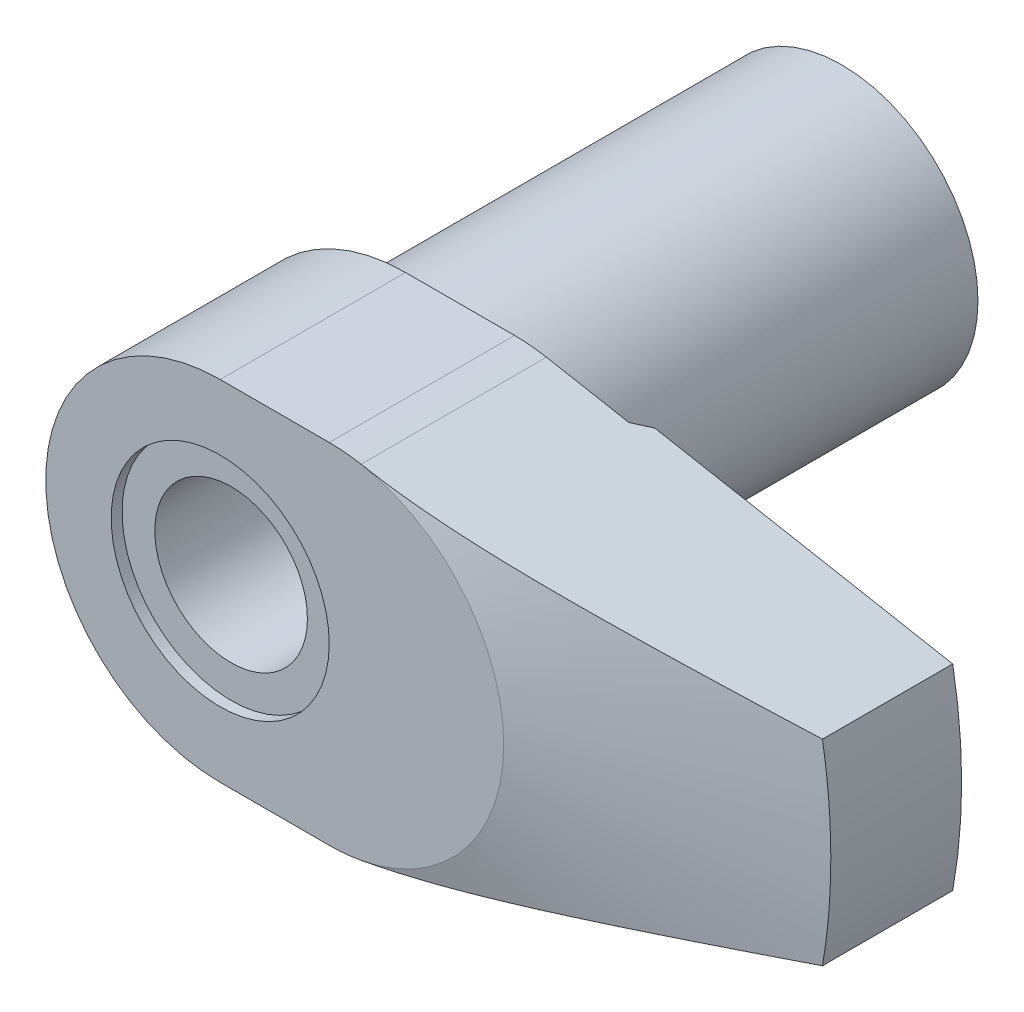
ISO-10303-21;
HEADER;
FILE_DESCRIPTION(('STEP AP214'),'2;1');
FILE_NAME('part.step','',(''),(''),'','','');
FILE_SCHEMA(('AUTOMOTIVE_DESIGN { 1 0 10303 214 1 1 1 1 }'));
ENDSEC;
DATA;
#1=APPLICATION_CONTEXT('core data for automotive mechanical design processes');
#2=APPLICATION_PROTOCOL_DEFINITION('international standard','automotive_design',2000,#1);
#3=PRODUCT_CONTEXT('',#1,'mechanical');
#4=PRODUCT('Part','Part','',(#3));
#5=PRODUCT_RELATED_PRODUCT_CATEGORY('part','',(#4));
#6=PRODUCT_DEFINITION_FORMATION('','',#4);
#7=PRODUCT_DEFINITION_CONTEXT('part definition',#1,'design');
#8=PRODUCT_DEFINITION('design','',#6,#7);
#9=PRODUCT_DEFINITION_SHAPE('','',#8);
#10=(LENGTH_UNIT() NAMED_UNIT(*) SI_UNIT(.MILLI.,.METRE.));
#11=(NAMED_UNIT(*) PLANE_ANGLE_UNIT() SI_UNIT($,.RADIAN.));
#12=(NAMED_UNIT(*) SI_UNIT($,.STERADIAN.) SOLID_ANGLE_UNIT());
#13=UNCERTAINTY_MEASURE_WITH_UNIT(LENGTH_MEASURE(1.E-05),#10,'distance_accuracy_value','');
#14=(GEOMETRIC_REPRESENTATION_CONTEXT(3) GLOBAL_UNCERTAINTY_ASSIGNED_CONTEXT((#13)) GLOBAL_UNIT_ASSIGNED_CONTEXT((#10,
#11,#12)) REPRESENTATION_CONTEXT('',''));
#15=CARTESIAN_POINT('',(0.,0.,0.));
#16=DIRECTION('',(0.,0.,1.));
#17=DIRECTION('',(1.,0.,0.));
#18=AXIS2_PLACEMENT_3D('',#15,#16,#17);
#19=CARTESIAN_POINT('',(49.1833305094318,9.,39.));
#20=DIRECTION('',(0.182505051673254,0.983204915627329,0.));
#21=DIRECTION('',(-0.983204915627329,0.182505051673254,0.));
#22=AXIS2_PLACEMENT_3D('',#19,#20,#21);
#23=PLANE('',#22);
#24=CARTESIAN_POINT('',(49.1835305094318,8.99996287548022,50.9490411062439));
#25=CARTESIAN_POINT('',(48.4363157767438,9.1386628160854,51.1233294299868));
#26=CARTESIAN_POINT('',(47.6889224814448,9.27739590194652,51.2968298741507));
#27=CARTESIAN_POINT('',(46.1937064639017,9.5549417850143,51.6419204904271));
#28=CARTESIAN_POINT('',(45.4458837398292,9.69375458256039,51.813510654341));
#29=CARTESIAN_POINT('',(43.9498561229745,9.97145111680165,52.1544189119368));
#30=CARTESIAN_POINT('',(43.2016513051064,10.1103348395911,52.3237373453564));
#31=CARTESIAN_POINT('',(41.7046595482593,10.3882103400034,52.6596906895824));
#32=CARTESIAN_POINT('',(40.9558726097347,10.527202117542,52.8263256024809));
#33=CARTESIAN_POINT('',(39.4594248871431,10.8049766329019,53.1559693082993));
#34=CARTESIAN_POINT('',(38.7117657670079,10.94375906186,53.3189859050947));
#35=CARTESIAN_POINT('',(37.2156374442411,11.2214742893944,53.641125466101));
#36=CARTESIAN_POINT('',(36.4671682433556,11.3604070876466,53.8002484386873));
#37=CARTESIAN_POINT('',(34.9690951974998,11.6384832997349,54.1137697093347));
#38=CARTESIAN_POINT('',(34.2194911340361,11.7776267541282,54.2681669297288));
#39=CARTESIAN_POINT('',(32.7191323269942,12.0561272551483,54.571090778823));
#40=CARTESIAN_POINT('',(31.9683775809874,12.1954843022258,54.719617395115));
#41=CARTESIAN_POINT('',(30.4629252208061,12.4749302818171,55.00987729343));
#42=CARTESIAN_POINT('',(29.7082229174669,12.6150200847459,55.1515855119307));
#43=CARTESIAN_POINT('',(28.1972026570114,12.8954995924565,55.4258274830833));
#44=CARTESIAN_POINT('',(27.4408847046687,13.0358892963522,55.5583612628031));
#45=CARTESIAN_POINT('',(25.9267833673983,13.3169407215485,55.8118665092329));
#46=CARTESIAN_POINT('',(25.1690009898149,13.4576022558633,55.9328441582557));
#47=CARTESIAN_POINT('',(23.6513180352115,13.7393185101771,56.1604558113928));
#48=CARTESIAN_POINT('',(22.8914174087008,13.8803732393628,56.2670894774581));
#49=CARTESIAN_POINT('',(21.3673908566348,14.163267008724,56.4628797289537));
#50=CARTESIAN_POINT('',(20.6032590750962,14.3051071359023,56.5519896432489));
#51=CARTESIAN_POINT('',(19.0728856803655,14.5891790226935,56.7086223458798));
#52=CARTESIAN_POINT('',(18.3066442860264,14.7314107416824,56.7761472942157));
#53=CARTESIAN_POINT('',(17.1552699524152,14.9451318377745,56.8586386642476));
#54=CARTESIAN_POINT('',(16.7707772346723,15.0165023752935,56.8830172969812));
#55=CARTESIAN_POINT('',(16.0014376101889,15.1593091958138,56.92510762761));
#56=CARTESIAN_POINT('',(15.6165907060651,15.2307454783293,56.9428193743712));
#57=CARTESIAN_POINT('',(14.8465043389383,15.3736909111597,56.9712828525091));
#58=CARTESIAN_POINT('',(14.4612647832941,15.4452000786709,56.9820320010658));
#59=CARTESIAN_POINT('',(13.6906447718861,15.5882445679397,56.9964020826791));
#60=CARTESIAN_POINT('',(13.3052643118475,15.6597798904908,57.0000227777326));
#61=CARTESIAN_POINT('',(12.9198808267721,15.731315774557,56.9999999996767));
#62=B_SPLINE_CURVE_WITH_KNOTS('',3,(#24,#25,#26,#27,#28,#29,#30,#31,#32,#33,#34,#35,#36,#37,#38,
#39,#40,#41,#42,#43,#44,#45,#46,#47,#48,#49,#50,#51,#52,#53,#54,#55,#56,#57,#58,#59,#60,#61),
.UNSPECIFIED.,.F.,.F.,(4,2,2,2,2,2,2,2,2,2,2,2,2,2,2,2,2,2,4),(0.,2.33912374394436,
4.67825752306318,7.01703749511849,9.35581564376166,11.6889301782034,14.0220396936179,
16.3556773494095,18.689319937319,21.0309713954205,23.372615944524,25.7130006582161,
28.0534405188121,30.4000316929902,32.7463879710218,33.9217995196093,35.0972024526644,
36.2730411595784,37.4489191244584),.UNSPECIFIED.);
#63=CARTESIAN_POINT('',(49.1833305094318,9.,50.9490877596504));
#64=VERTEX_POINT('',#63);
#65=CARTESIAN_POINT('',(12.9200808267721,15.7312786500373,57.));
#66=VERTEX_POINT('',#65);
#67=EDGE_CURVE('E98',#64,#66,#62,.T.);
#68=ORIENTED_EDGE('',*,*,#67,.F.);
#69=DIRECTION('',(0.,0.,1.));
#70=VECTOR('',#69,1.);
#71=CARTESIAN_POINT('',(49.1833305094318,9.,39.));
#72=LINE('',#71,#70);
#73=CARTESIAN_POINT('',(49.1833305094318,9.,39.));
#74=VERTEX_POINT('',#73);
#75=EDGE_CURVE('E147',#74,#64,#72,.T.);
#76=ORIENTED_EDGE('',*,*,#75,.F.);
#77=DIRECTION('',(-0.983204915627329,0.182505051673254,0.));
#78=VECTOR('',#77,1.);
#79=CARTESIAN_POINT('',(49.1833305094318,9.,39.));
#80=LINE('',#79,#78);
#81=CARTESIAN_POINT('',(21.8632225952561,14.0712294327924,39.));
#82=VERTEX_POINT('',#81);
#83=EDGE_CURVE('E154',#74,#82,#80,.T.);
#84=ORIENTED_EDGE('',*,*,#83,.T.);
#85=CARTESIAN_POINT('',(21.8634927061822,14.0711792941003,38.9998));
#86=CARTESIAN_POINT('',(21.7495401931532,14.092331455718,39.0841746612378));
#87=CARTESIAN_POINT('',(21.6354174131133,14.1135152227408,39.1683116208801));
#88=CARTESIAN_POINT('',(21.4068219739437,14.1559477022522,39.3360875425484));
#89=CARTESIAN_POINT('',(21.2923493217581,14.177196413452,39.4197265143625));
#90=CARTESIAN_POINT('',(21.0630401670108,14.2197613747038,39.586487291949));
#91=CARTESIAN_POINT('',(20.948203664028,14.2410776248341,39.6696090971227));
#92=CARTESIAN_POINT('',(20.7181524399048,14.2837803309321,39.8353143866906));
#93=CARTESIAN_POINT('',(20.60293771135,14.305166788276,39.917897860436));
#94=CARTESIAN_POINT('',(20.4875288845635,14.3265892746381,40.0002));
#95=B_SPLINE_CURVE_WITH_KNOTS('',3,(#85,#86,#87,#88,#89,#90,#91,#92,#93,#94),.UNSPECIFIED.,.F.,
.F.,(4,2,2,2,4),(0.,0.430075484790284,0.860142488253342,1.29020998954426,1.72028597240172),.UNSPECIFIED.);
#96=CARTESIAN_POINT('',(20.4878093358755,14.3265372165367,40.));
#97=VERTEX_POINT('',#96);
#98=EDGE_CURVE('E187',#82,#97,#95,.T.);
#99=ORIENTED_EDGE('',*,*,#98,.T.);
#100=DIRECTION('',(0.983204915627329,-0.182505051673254,0.));
#101=VECTOR('',#100,1.);
#102=CARTESIAN_POINT('',(12.9200808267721,15.7312786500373,40.));
#103=LINE('',#102,#101);
#104=CARTESIAN_POINT('',(12.9200808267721,15.7312786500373,40.));
#105=VERTEX_POINT('',#104);
#106=EDGE_CURVE('E227',#105,#97,#103,.T.);
#107=ORIENTED_EDGE('',*,*,#106,.F.);
#108=DIRECTION('',(0.,0.,1.));
#109=VECTOR('',#108,1.);
#110=CARTESIAN_POINT('',(12.9200808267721,15.7312786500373,39.));
#111=LINE('',#110,#109);
#112=EDGE_CURVE('E145',#105,#66,#111,.T.);
#113=ORIENTED_EDGE('',*,*,#112,.T.);
#114=EDGE_LOOP('',(#68,#76,#84,#99,#107,#113));
#115=FACE_BOUND('',#114,.T.);
#116=ADVANCED_FACE('F14',(#115),#23,.T.);
#117=CARTESIAN_POINT('',(49.1833305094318,-9.,39.));
#118=DIRECTION('',(0.182505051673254,-0.983204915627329,0.));
#119=DIRECTION('',(0.983204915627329,0.182505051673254,0.));
#120=AXIS2_PLACEMENT_3D('',#117,#118,#119);
#121=PLANE('',#120);
#122=CARTESIAN_POINT('',(12.9198808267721,-15.731315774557,56.9999999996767));
#123=CARTESIAN_POINT('',(13.2556839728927,-15.6689831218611,57.000013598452));
#124=CARTESIAN_POINT('',(13.5914855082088,-15.6066507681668,56.9972685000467));
#125=CARTESIAN_POINT('',(14.2629969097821,-15.4820030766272,56.9863525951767));
#126=CARTESIAN_POINT('',(14.598706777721,-15.4196877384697,56.9781818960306));
#127=CARTESIAN_POINT('',(15.2698792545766,-15.2951029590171,56.9565090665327));
#128=CARTESIAN_POINT('',(15.6053419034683,-15.2328335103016,56.9430082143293));
#129=CARTESIAN_POINT('',(16.2760267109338,-15.1083392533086,56.9108512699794));
#130=CARTESIAN_POINT('',(16.6112488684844,-15.0461144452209,56.8921951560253));
#131=CARTESIAN_POINT('',(17.6154285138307,-14.8597160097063,56.828881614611));
#132=CARTESIAN_POINT('',(18.2839458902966,-14.7356240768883,56.7768438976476));
#133=CARTESIAN_POINT('',(19.6194519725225,-14.4877239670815,56.6552810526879));
#134=CARTESIAN_POINT('',(20.2864405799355,-14.3639158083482,56.5857548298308));
#135=CARTESIAN_POINT('',(21.6170626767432,-14.1169222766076,56.4318958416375));
#136=CARTESIAN_POINT('',(22.2807003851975,-13.9937361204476,56.347600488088));
#137=CARTESIAN_POINT('',(23.6062973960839,-13.7476753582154,56.1664804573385));
#138=CARTESIAN_POINT('',(24.268256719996,-13.624800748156,56.0696559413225));
#139=CARTESIAN_POINT('',(25.5909090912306,-13.3792865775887,55.8655833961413));
#140=CARTESIAN_POINT('',(26.2516014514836,-13.2566471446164,55.7583307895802));
#141=CARTESIAN_POINT('',(27.5715919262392,-13.0116270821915,55.5352732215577));
#142=CARTESIAN_POINT('',(28.230890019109,-12.8892464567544,55.419468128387));
#143=CARTESIAN_POINT('',(29.7391756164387,-12.6092745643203,55.1462586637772));
#144=CARTESIAN_POINT('',(30.5877543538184,-12.4517591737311,54.9865259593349));
#145=CARTESIAN_POINT('',(32.2832079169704,-12.1370446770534,54.657987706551));
#146=CARTESIAN_POINT('',(33.1300827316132,-11.9798455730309,54.4891820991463));
#147=CARTESIAN_POINT('',(34.8223003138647,-11.6657317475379,54.1444787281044));
#148=CARTESIAN_POINT('',(35.6676432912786,-11.5088169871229,53.9685820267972));
#149=CARTESIAN_POINT('',(37.3571768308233,-11.1952013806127,53.6111544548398));
#150=CARTESIAN_POINT('',(38.2013673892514,-11.0385005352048,53.429623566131));
#151=CARTESIAN_POINT('',(39.8914780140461,-10.7247778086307,53.0614697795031));
#152=CARTESIAN_POINT('',(40.7373950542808,-10.5677564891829,52.874832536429));
#153=CARTESIAN_POINT('',(42.4284393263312,-10.2538604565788,52.4978887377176));
#154=CARTESIAN_POINT('',(43.2735665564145,-10.096985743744,52.307582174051));
#155=CARTESIAN_POINT('',(44.963151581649,-9.78336058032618,51.9239804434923));
#156=CARTESIAN_POINT('',(45.807609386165,-9.62661012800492,51.7306853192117));
#157=CARTESIAN_POINT('',(47.4959636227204,-9.31321342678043,51.3416056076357));
#158=CARTESIAN_POINT('',(48.3398600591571,-9.15656717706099,51.1458210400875));
#159=CARTESIAN_POINT('',(49.1835305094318,-8.99996287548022,50.9490411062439));
#160=B_SPLINE_CURVE_WITH_KNOTS('',3,(#122,#123,#124,#125,#126,#127,#128,#129,#130,#131,#132,
#133,#134,#135,#136,#137,#138,#139,#140,#141,#142,#143,#144,#145,#146,#147,#148,#149,#150,#151,
#152,#153,#154,#155,#156,#157,#158,#159),.UNSPECIFIED.,.F.,.F.,(4,2,2,2,2,2,2,2,2,2,2,2,2,2,2,2,
2,2,4),(0.,1.0246041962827,2.04918812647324,3.07352651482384,4.09786923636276,6.14336042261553,
8.18897969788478,10.2294902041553,12.2699744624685,14.3113584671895,16.3527739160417,
18.9859001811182,21.6190435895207,24.2517939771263,26.8845528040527,29.5256759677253,
32.1668049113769,34.8078962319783,37.4489666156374),.UNSPECIFIED.);
#161=CARTESIAN_POINT('',(12.9200808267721,-15.7312786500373,57.));
#162=VERTEX_POINT('',#161);
#163=CARTESIAN_POINT('',(49.1833305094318,-9.,50.9490877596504));
#164=VERTEX_POINT('',#163);
#165=EDGE_CURVE('E34',#162,#164,#160,.T.);
#166=ORIENTED_EDGE('',*,*,#165,.F.);
#167=DIRECTION('',(0.,0.,1.));
#168=VECTOR('',#167,1.);
#169=CARTESIAN_POINT('',(12.9200808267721,-15.7312786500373,39.));
#170=LINE('',#169,#168);
#171=CARTESIAN_POINT('',(12.9200808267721,-15.7312786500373,40.));
#172=VERTEX_POINT('',#171);
#173=EDGE_CURVE('E110',#172,#162,#170,.T.);
#174=ORIENTED_EDGE('',*,*,#173,.F.);
#175=DIRECTION('',(-0.983204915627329,-0.182505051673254,0.));
#176=VECTOR('',#175,1.);
#177=CARTESIAN_POINT('',(20.4878093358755,-14.3265372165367,40.));
#178=LINE('',#177,#176);
#179=CARTESIAN_POINT('',(20.4878093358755,-14.3265372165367,40.));
#180=VERTEX_POINT('',#179);
#181=EDGE_CURVE('E214',#180,#172,#178,.T.);
#182=ORIENTED_EDGE('',*,*,#181,.F.);
#183=CARTESIAN_POINT('',(20.4875288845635,-14.3265892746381,40.0002));
#184=CARTESIAN_POINT('',(20.60293771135,-14.305166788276,39.917897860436));
#185=CARTESIAN_POINT('',(20.7181524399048,-14.2837803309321,39.8353143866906));
#186=CARTESIAN_POINT('',(20.948203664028,-14.2410776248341,39.6696090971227));
#187=CARTESIAN_POINT('',(21.0630401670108,-14.2197613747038,39.586487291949));
#188=CARTESIAN_POINT('',(21.2923493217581,-14.177196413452,39.4197265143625));
#189=CARTESIAN_POINT('',(21.4068219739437,-14.1559477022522,39.3360875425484));
#190=CARTESIAN_POINT('',(21.6354174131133,-14.1135152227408,39.1683116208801));
#191=CARTESIAN_POINT('',(21.7495401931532,-14.092331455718,39.0841746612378));
#192=CARTESIAN_POINT('',(21.8634927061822,-14.0711792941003,38.9998));
#193=B_SPLINE_CURVE_WITH_KNOTS('',3,(#183,#184,#185,#186,#187,#188,#189,#190,#191,#192),
.UNSPECIFIED.,.F.,.F.,(4,2,2,2,4),(0.,0.430075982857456,0.860143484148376,1.29021048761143,
1.72028597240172),.UNSPECIFIED.);
#194=CARTESIAN_POINT('',(21.8632225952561,-14.0712294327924,39.));
#195=VERTEX_POINT('',#194);
#196=EDGE_CURVE('E28',#180,#195,#193,.T.);
#197=ORIENTED_EDGE('',*,*,#196,.T.);
#198=DIRECTION('',(0.983204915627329,0.182505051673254,0.));
#199=VECTOR('',#198,1.);
#200=CARTESIAN_POINT('',(49.1833305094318,-9.,39.));
#201=LINE('',#200,#199);
#202=CARTESIAN_POINT('',(49.1833305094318,-9.,39.));
#203=VERTEX_POINT('',#202);
#204=EDGE_CURVE('E139',#195,#203,#201,.T.);
#205=ORIENTED_EDGE('',*,*,#204,.T.);
#206=DIRECTION('',(0.,0.,1.));
#207=VECTOR('',#206,1.);
#208=CARTESIAN_POINT('',(49.1833305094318,-9.,39.));
#209=LINE('',#208,#207);
#210=EDGE_CURVE('E112',#203,#164,#209,.T.);
#211=ORIENTED_EDGE('',*,*,#210,.T.);
#212=EDGE_LOOP('',(#166,#174,#182,#197,#205,#211));
#213=FACE_BOUND('',#212,.T.);
#214=ADVANCED_FACE('F108',(#213),#121,.T.);
#215=CARTESIAN_POINT('',(0.,16.,39.));
#216=DIRECTION('',(0.,1.,0.));
#217=DIRECTION('',(-1.,0.,0.));
#218=AXIS2_PLACEMENT_3D('',#215,#216,#217);
#219=PLANE('',#218);
#220=DIRECTION('',(0.,0.,1.));
#221=VECTOR('',#220,1.);
#222=CARTESIAN_POINT('',(10.,16.,39.));
#223=LINE('',#222,#221);
#224=CARTESIAN_POINT('',(10.,16.,40.));
#225=VERTEX_POINT('',#224);
#226=CARTESIAN_POINT('',(10.,16.,57.));
#227=VERTEX_POINT('',#226);
#228=EDGE_CURVE('E143',#225,#227,#223,.T.);
#229=ORIENTED_EDGE('',*,*,#228,.F.);
#230=DIRECTION('',(1.,0.,0.));
#231=VECTOR('',#230,1.);
#232=CARTESIAN_POINT('',(0.,16.,40.));
#233=LINE('',#232,#231);
#234=CARTESIAN_POINT('',(0.,16.,40.));
#235=VERTEX_POINT('',#234);
#236=EDGE_CURVE('E223',#235,#225,#233,.T.);
#237=ORIENTED_EDGE('',*,*,#236,.F.);
#238=DIRECTION('',(0.,0.,1.));
#239=VECTOR('',#238,1.);
#240=CARTESIAN_POINT('',(0.,16.,39.));
#241=LINE('',#240,#239);
#242=CARTESIAN_POINT('',(0.,16.,57.));
#243=VERTEX_POINT('',#242);
#244=EDGE_CURVE('E140',#235,#243,#241,.T.);
#245=ORIENTED_EDGE('',*,*,#244,.T.);
#246=DIRECTION('',(-1.,0.,0.));
#247=VECTOR('',#246,1.);
#248=CARTESIAN_POINT('',(0.,16.,57.));
#249=LINE('',#248,#247);
#250=EDGE_CURVE('E131',#227,#243,#249,.T.);
#251=ORIENTED_EDGE('',*,*,#250,.F.);
#252=EDGE_LOOP('',(#229,#237,#245,#251));
#253=FACE_BOUND('',#252,.T.);
#254=ADVANCED_FACE('F312',(#253),#219,.T.);
#255=CARTESIAN_POINT('',(10.,0.,39.));
#256=DIRECTION('',(0.,0.,1.));
#257=DIRECTION('',(1.,0.,0.));
#258=AXIS2_PLACEMENT_3D('',#255,#256,#257);
#259=CYLINDRICAL_SURFACE('',#258,16.);
#260=ORIENTED_EDGE('',*,*,#112,.F.);
#261=CARTESIAN_POINT('',(10.,0.,40.));
#262=DIRECTION('',(0.,0.,-1.));
#263=DIRECTION('',(-1.,0.,0.));
#264=AXIS2_PLACEMENT_3D('',#261,#262,#263);
#265=CIRCLE('',#264,16.);
#266=EDGE_CURVE('E225',#225,#105,#265,.T.);
#267=ORIENTED_EDGE('',*,*,#266,.F.);
#268=ORIENTED_EDGE('',*,*,#228,.T.);
#269=CARTESIAN_POINT('',(10.,0.,57.));
#270=DIRECTION('',(0.,0.,1.));
#271=DIRECTION('',(1.,0.,0.));
#272=AXIS2_PLACEMENT_3D('',#269,#270,#271);
#273=CIRCLE('',#272,16.);
#274=EDGE_CURVE('E129',#66,#227,#273,.T.);
#275=ORIENTED_EDGE('',*,*,#274,.F.);
#276=EDGE_LOOP('',(#260,#267,#268,#275));
#277=FACE_BOUND('',#276,.T.);
#278=ADVANCED_FACE('F204',(#277),#259,.T.);
#279=CARTESIAN_POINT('',(10.,0.,39.));
#280=DIRECTION('',(0.,0.,1.));
#281=DIRECTION('',(1.,0.,0.));
#282=AXIS2_PLACEMENT_3D('',#279,#280,#281);
#283=CYLINDRICAL_SURFACE('',#282,16.);
#284=DIRECTION('',(0.,0.,1.));
#285=VECTOR('',#284,1.);
#286=CARTESIAN_POINT('',(10.,-16.,39.));
#287=LINE('',#286,#285);
#288=CARTESIAN_POINT('',(10.,-16.,40.));
#289=VERTEX_POINT('',#288);
#290=CARTESIAN_POINT('',(10.,-16.,57.));
#291=VERTEX_POINT('',#290);
#292=EDGE_CURVE('E122',#289,#291,#287,.T.);
#293=ORIENTED_EDGE('',*,*,#292,.F.);
#294=CARTESIAN_POINT('',(10.,0.,40.));
#295=DIRECTION('',(0.,0.,-1.));
#296=DIRECTION('',(-1.,0.,0.));
#297=AXIS2_PLACEMENT_3D('',#294,#295,#296);
#298=CIRCLE('',#297,16.);
#299=EDGE_CURVE('E121',#172,#289,#298,.T.);
#300=ORIENTED_EDGE('',*,*,#299,.F.);
#301=ORIENTED_EDGE('',*,*,#173,.T.);
#302=CARTESIAN_POINT('',(10.,0.,57.));
#303=DIRECTION('',(0.,0.,1.));
#304=DIRECTION('',(1.,0.,0.));
#305=AXIS2_PLACEMENT_3D('',#302,#303,#304);
#306=CIRCLE('',#305,16.);
#307=EDGE_CURVE('E119',#291,#162,#306,.T.);
#308=ORIENTED_EDGE('',*,*,#307,.F.);
#309=EDGE_LOOP('',(#293,#300,#301,#308));
#310=FACE_BOUND('',#309,.T.);
#311=ADVANCED_FACE('F118',(#310),#283,.T.);
#312=CARTESIAN_POINT('',(10.,-16.,39.));
#313=DIRECTION('',(0.,-1.,0.));
#314=DIRECTION('',(1.,0.,0.));
#315=AXIS2_PLACEMENT_3D('',#312,#313,#314);
#316=PLANE('',#315);
#317=DIRECTION('',(0.,0.,1.));
#318=VECTOR('',#317,1.);
#319=CARTESIAN_POINT('',(1.6759120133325E-13,-16.,39.));
#320=LINE('',#319,#318);
#321=CARTESIAN_POINT('',(1.73469311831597E-13,-16.,40.));
#322=VERTEX_POINT('',#321);
#323=CARTESIAN_POINT('',(1.6759120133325E-13,-16.,57.));
#324=VERTEX_POINT('',#323);
#325=EDGE_CURVE('E152',#322,#324,#320,.T.);
#326=ORIENTED_EDGE('',*,*,#325,.F.);
#327=DIRECTION('',(-1.,0.,0.));
#328=VECTOR('',#327,1.);
#329=CARTESIAN_POINT('',(10.,-16.,40.));
#330=LINE('',#329,#328);
#331=EDGE_CURVE('E221',#289,#322,#330,.T.);
#332=ORIENTED_EDGE('',*,*,#331,.F.);
#333=ORIENTED_EDGE('',*,*,#292,.T.);
#334=DIRECTION('',(1.,0.,0.));
#335=VECTOR('',#334,1.);
#336=CARTESIAN_POINT('',(10.,-16.,57.));
#337=LINE('',#336,#335);
#338=EDGE_CURVE('E128',#324,#291,#337,.T.);
#339=ORIENTED_EDGE('',*,*,#338,.F.);
#340=EDGE_LOOP('',(#326,#332,#333,#339));
#341=FACE_BOUND('',#340,.T.);
#342=ADVANCED_FACE('F257',(#341),#316,.T.);
#343=CARTESIAN_POINT('',(60.,20.,39.));
#344=DIRECTION('',(0.,0.,1.));
#345=DIRECTION('',(1.,0.,0.));
#346=AXIS2_PLACEMENT_3D('',#343,#344,#345);
#347=PLANE('',#346);
#348=CARTESIAN_POINT('',(0.,0.,39.));
#349=DIRECTION('',(0.,0.,-1.));
#350=DIRECTION('',(-1.,0.,0.));
#351=AXIS2_PLACEMENT_3D('',#348,#349,#350);
#352=CIRCLE('',#351,26.);
#353=EDGE_CURVE('E42',#82,#195,#352,.T.);
#354=ORIENTED_EDGE('',*,*,#353,.F.);
#355=ORIENTED_EDGE('',*,*,#83,.F.);
#356=CARTESIAN_POINT('',(0.,0.,39.));
#357=DIRECTION('',(0.,0.,1.));
#358=DIRECTION('',(1.,0.,0.));
#359=AXIS2_PLACEMENT_3D('',#356,#357,#358);
#360=CIRCLE('',#359,50.);
#361=EDGE_CURVE('E239',#203,#74,#360,.T.);
#362=ORIENTED_EDGE('',*,*,#361,.F.);
#363=ORIENTED_EDGE('',*,*,#204,.F.);
#364=EDGE_LOOP('',(#354,#355,#362,#363));
#365=FACE_BOUND('',#364,.T.);
#366=ADVANCED_FACE('F235',(#365),#347,.F.);
#367=CARTESIAN_POINT('',(0.,0.,57.));
#368=DIRECTION('',(0.,0.,-1.));
#369=DIRECTION('',(-1.,0.,0.));
#370=AXIS2_PLACEMENT_3D('',#367,#368,#369);
#371=CYLINDRICAL_SURFACE('',#370,16.);
#372=CARTESIAN_POINT('',(0.,0.,40.));
#373=DIRECTION('',(0.,0.,1.));
#374=DIRECTION('',(1.,0.,0.));
#375=AXIS2_PLACEMENT_3D('',#372,#373,#374);
#376=CIRCLE('',#375,16.);
#377=EDGE_CURVE('E196',#235,#322,#376,.T.);
#378=ORIENTED_EDGE('',*,*,#377,.T.);
#379=ORIENTED_EDGE('',*,*,#325,.T.);
#380=CARTESIAN_POINT('',(0.,0.,57.));
#381=DIRECTION('',(0.,0.,1.));
#382=DIRECTION('',(1.,0.,0.));
#383=AXIS2_PLACEMENT_3D('',#380,#381,#382);
#384=CIRCLE('',#383,16.);
#385=EDGE_CURVE('E167',#243,#324,#384,.T.);
#386=ORIENTED_EDGE('',*,*,#385,.F.);
#387=ORIENTED_EDGE('',*,*,#244,.F.);
#388=EDGE_LOOP('',(#378,#379,#386,#387));
#389=FACE_BOUND('',#388,.T.);
#390=ADVANCED_FACE('F16',(#389),#371,.T.);
#391=CARTESIAN_POINT('',(0.,0.,57.));
#392=DIRECTION('',(0.,0.,-1.));
#393=DIRECTION('',(-1.,0.,0.));
#394=AXIS2_PLACEMENT_3D('',#391,#392,#393);
#395=CYLINDRICAL_SURFACE('',#394,7.);
#396=CARTESIAN_POINT('',(0.,0.,0.));
#397=DIRECTION('',(0.,0.,1.));
#398=DIRECTION('',(1.,0.,0.));
#399=AXIS2_PLACEMENT_3D('',#396,#397,#398);
#400=CIRCLE('',#399,7.);
#401=CARTESIAN_POINT('',(7.,0.,0.));
#402=VERTEX_POINT('',#401);
#403=EDGE_CURVE('E164',#402,#402,#400,.T.);
#404=ORIENTED_EDGE('',*,*,#403,.F.);
#405=EDGE_LOOP('',(#404));
#406=FACE_BOUND('',#405,.T.);
#407=CARTESIAN_POINT('',(0.,0.,56.));
#408=DIRECTION('',(0.,0.,1.));
#409=DIRECTION('',(1.,0.,0.));
#410=AXIS2_PLACEMENT_3D('',#407,#408,#409);
#411=CIRCLE('',#410,7.);
#412=CARTESIAN_POINT('',(7.,0.,56.));
#413=VERTEX_POINT('',#412);
#414=EDGE_CURVE('E158',#413,#413,#411,.T.);
#415=ORIENTED_EDGE('',*,*,#414,.T.);
#416=EDGE_LOOP('',(#415));
#417=FACE_BOUND('',#416,.T.);
#418=ADVANCED_FACE('F282',(#406,#417),#395,.F.);
#419=CARTESIAN_POINT('',(0.,0.,0.));
#420=DIRECTION('',(0.,0.,1.));
#421=DIRECTION('',(1.,0.,0.));
#422=AXIS2_PLACEMENT_3D('',#419,#420,#421);
#423=PLANE('',#422);
#424=ORIENTED_EDGE('',*,*,#403,.T.);
#425=EDGE_LOOP('',(#424));
#426=FACE_BOUND('',#425,.T.);
#427=CARTESIAN_POINT('',(0.,0.,0.));
#428=DIRECTION('',(0.,0.,-1.));
#429=DIRECTION('',(-1.,0.,0.));
#430=AXIS2_PLACEMENT_3D('',#427,#428,#429);
#431=CIRCLE('',#430,12.5);
#432=CARTESIAN_POINT('',(-12.5,0.,0.));
#433=VERTEX_POINT('',#432);
#434=EDGE_CURVE('E161',#433,#433,#431,.T.);
#435=ORIENTED_EDGE('',*,*,#434,.T.);
#436=EDGE_LOOP('',(#435));
#437=FACE_BOUND('',#436,.T.);
#438=ADVANCED_FACE('F276',(#426,#437),#423,.F.);
#439=CARTESIAN_POINT('',(0.,0.,57.));
#440=DIRECTION('',(0.,0.,1.));
#441=DIRECTION('',(1.,0.,0.));
#442=AXIS2_PLACEMENT_3D('',#439,#440,#441);
#443=PLANE('',#442);
#444=CARTESIAN_POINT('',(10.,0.,57.));
#445=DIRECTION('',(0.,0.,1.));
#446=DIRECTION('',(1.,0.,0.));
#447=AXIS2_PLACEMENT_3D('',#444,#445,#446);
#448=CIRCLE('',#447,16.);
#449=EDGE_CURVE('E95',#162,#66,#448,.T.);
#450=ORIENTED_EDGE('',*,*,#449,.T.);
#451=ORIENTED_EDGE('',*,*,#274,.T.);
#452=ORIENTED_EDGE('',*,*,#250,.T.);
#453=ORIENTED_EDGE('',*,*,#385,.T.);
#454=ORIENTED_EDGE('',*,*,#338,.T.);
#455=ORIENTED_EDGE('',*,*,#307,.T.);
#456=EDGE_LOOP('',(#450,#451,#452,#453,#454,#455));
#457=FACE_BOUND('',#456,.T.);
#458=CARTESIAN_POINT('',(0.,0.,57.));
#459=DIRECTION('',(0.,0.,1.));
#460=DIRECTION('',(1.,0.,0.));
#461=AXIS2_PLACEMENT_3D('',#458,#459,#460);
#462=CIRCLE('',#461,10.);
#463=CARTESIAN_POINT('',(10.,0.,57.));
#464=VERTEX_POINT('',#463);
#465=EDGE_CURVE('E142',#464,#464,#462,.T.);
#466=ORIENTED_EDGE('',*,*,#465,.F.);
#467=EDGE_LOOP('',(#466));
#468=FACE_BOUND('',#467,.T.);
#469=ADVANCED_FACE('F124',(#457,#468),#443,.T.);
#470=CARTESIAN_POINT('',(0.,0.,39.));
#471=DIRECTION('',(0.,0.,-1.));
#472=DIRECTION('',(-1.,0.,0.));
#473=AXIS2_PLACEMENT_3D('',#470,#471,#472);
#474=CYLINDRICAL_SURFACE('',#473,12.5);
#475=ORIENTED_EDGE('',*,*,#434,.F.);
#476=EDGE_LOOP('',(#475));
#477=FACE_BOUND('',#476,.T.);
#478=CARTESIAN_POINT('',(0.,0.,40.));
#479=DIRECTION('',(0.,0.,1.));
#480=DIRECTION('',(1.,0.,0.));
#481=AXIS2_PLACEMENT_3D('',#478,#479,#480);
#482=CIRCLE('',#481,12.5);
#483=CARTESIAN_POINT('',(12.5,0.,40.));
#484=VERTEX_POINT('',#483);
#485=EDGE_CURVE('E133',#484,#484,#482,.T.);
#486=ORIENTED_EDGE('',*,*,#485,.F.);
#487=EDGE_LOOP('',(#486));
#488=FACE_BOUND('',#487,.T.);
#489=ADVANCED_FACE('F262',(#477,#488),#474,.T.);
#490=CARTESIAN_POINT('',(0.,0.,56.));
#491=DIRECTION('',(0.,0.,1.));
#492=DIRECTION('',(1.,0.,0.));
#493=AXIS2_PLACEMENT_3D('',#490,#491,#492);
#494=CYLINDRICAL_SURFACE('',#493,10.);
#495=CARTESIAN_POINT('',(0.,0.,56.));
#496=DIRECTION('',(0.,0.,1.));
#497=DIRECTION('',(1.,0.,0.));
#498=AXIS2_PLACEMENT_3D('',#495,#496,#497);
#499=CIRCLE('',#498,10.);
#500=CARTESIAN_POINT('',(10.,0.,56.));
#501=VERTEX_POINT('',#500);
#502=EDGE_CURVE('E155',#501,#501,#499,.T.);
#503=ORIENTED_EDGE('',*,*,#502,.F.);
#504=EDGE_LOOP('',(#503));
#505=FACE_BOUND('',#504,.T.);
#506=ORIENTED_EDGE('',*,*,#465,.T.);
#507=EDGE_LOOP('',(#506));
#508=FACE_BOUND('',#507,.T.);
#509=ADVANCED_FACE('F264',(#505,#508),#494,.F.);
#510=CARTESIAN_POINT('',(0.,0.,56.));
#511=DIRECTION('',(0.,0.,1.));
#512=DIRECTION('',(1.,0.,0.));
#513=AXIS2_PLACEMENT_3D('',#510,#511,#512);
#514=PLANE('',#513);
#515=ORIENTED_EDGE('',*,*,#414,.F.);
#516=EDGE_LOOP('',(#515));
#517=FACE_BOUND('',#516,.T.);
#518=ORIENTED_EDGE('',*,*,#502,.T.);
#519=EDGE_LOOP('',(#518));
#520=FACE_BOUND('',#519,.T.);
#521=ADVANCED_FACE('F273',(#517,#520),#514,.T.);
#522=CARTESIAN_POINT('',(0.,0.,39.));
#523=DIRECTION('',(0.,0.,1.));
#524=DIRECTION('',(1.,0.,0.));
#525=AXIS2_PLACEMENT_3D('',#522,#523,#524);
#526=CYLINDRICAL_SURFACE('',#525,50.);
#527=CARTESIAN_POINT('',(49.1832939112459,-9.0002,50.9490854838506));
#528=CARTESIAN_POINT('',(49.3196030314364,-8.25538525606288,50.9575623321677));
#529=CARTESIAN_POINT('',(49.4389702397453,-7.50745839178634,50.9649950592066));
#530=CARTESIAN_POINT('',(49.6436263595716,-6.00694322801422,50.9777491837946));
#531=CARTESIAN_POINT('',(49.7289154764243,-5.25435495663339,50.9830705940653));
#532=CARTESIAN_POINT('',(49.8646672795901,-3.75221544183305,50.9915444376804));
#533=CARTESIAN_POINT('',(49.9154080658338,-3.00268941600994,50.9947141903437));
#534=CARTESIAN_POINT('',(49.9830743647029,-1.50210892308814,50.9989419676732));
#535=CARTESIAN_POINT('',(50.,-0.751054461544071,51.));
#536=CARTESIAN_POINT('',(50.,0.751054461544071,51.));
#537=CARTESIAN_POINT('',(49.9830743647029,1.50210892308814,50.9989419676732));
#538=CARTESIAN_POINT('',(49.9154080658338,3.00268941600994,50.9947141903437));
#539=CARTESIAN_POINT('',(49.8646672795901,3.75221544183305,50.9915444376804));
#540=CARTESIAN_POINT('',(49.7289154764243,5.25435495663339,50.9830705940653));
#541=CARTESIAN_POINT('',(49.6436263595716,6.00694322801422,50.9777491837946));
#542=CARTESIAN_POINT('',(49.4389702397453,7.50745839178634,50.9649950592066));
#543=CARTESIAN_POINT('',(49.3196030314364,8.25538525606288,50.9575623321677));
#544=CARTESIAN_POINT('',(49.1832939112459,9.0002,50.9490854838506));
#545=B_SPLINE_CURVE_WITH_KNOTS('',3,(#527,#528,#529,#530,#531,#532,#533,#534,#535,#536,#537,
#538,#539,#540,#541,#542,#543,#544),.UNSPECIFIED.,.F.,.F.,(4,2,2,2,2,2,2,2,4),(0.,
2.27150161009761,4.54298953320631,6.79596960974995,9.04894151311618,11.3019134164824,
13.5548934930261,15.8263814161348,18.0978830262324),.UNSPECIFIED.);
#546=EDGE_CURVE('E9',#164,#64,#545,.T.);
#547=ORIENTED_EDGE('',*,*,#546,.F.);
#548=ORIENTED_EDGE('',*,*,#210,.F.);
#549=ORIENTED_EDGE('',*,*,#361,.T.);
#550=ORIENTED_EDGE('',*,*,#75,.T.);
#551=EDGE_LOOP('',(#547,#548,#549,#550));
#552=FACE_BOUND('',#551,.T.);
#553=ADVANCED_FACE('F205',(#552),#526,.T.);
#554=CARTESIAN_POINT('',(-12.5,0.,40.));
#555=DIRECTION('',(0.,0.,-1.));
#556=DIRECTION('',(-1.,0.,0.));
#557=AXIS2_PLACEMENT_3D('',#554,#555,#556);
#558=PLANE('',#557);
#559=ORIENTED_EDGE('',*,*,#485,.T.);
#560=EDGE_LOOP('',(#559));
#561=FACE_BOUND('',#560,.T.);
#562=ORIENTED_EDGE('',*,*,#377,.F.);
#563=ORIENTED_EDGE('',*,*,#236,.T.);
#564=ORIENTED_EDGE('',*,*,#266,.T.);
#565=ORIENTED_EDGE('',*,*,#106,.T.);
#566=CARTESIAN_POINT('',(0.,0.,40.));
#567=DIRECTION('',(0.,0.,-1.));
#568=DIRECTION('',(-1.,0.,0.));
#569=AXIS2_PLACEMENT_3D('',#566,#567,#568);
#570=CIRCLE('',#569,25.);
#571=EDGE_CURVE('E197',#97,#180,#570,.T.);
#572=ORIENTED_EDGE('',*,*,#571,.T.);
#573=ORIENTED_EDGE('',*,*,#181,.T.);
#574=ORIENTED_EDGE('',*,*,#299,.T.);
#575=ORIENTED_EDGE('',*,*,#331,.T.);
#576=EDGE_LOOP('',(#562,#563,#564,#565,#572,#573,#574,#575));
#577=FACE_BOUND('',#576,.T.);
#578=ADVANCED_FACE('F182',(#561,#577),#558,.T.);
#579=CARTESIAN_POINT('',(0.,0.,40.));
#580=DIRECTION('',(0.,0.,-1.));
#581=DIRECTION('',(-1.,0.,0.));
#582=AXIS2_PLACEMENT_3D('',#579,#580,#581);
#583=CONICAL_SURFACE('',#582,25.,0.785398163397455);
#584=ORIENTED_EDGE('',*,*,#353,.T.);
#585=ORIENTED_EDGE('',*,*,#196,.F.);
#586=ORIENTED_EDGE('',*,*,#571,.F.);
#587=ORIENTED_EDGE('',*,*,#98,.F.);
#588=EDGE_LOOP('',(#584,#585,#586,#587));
#589=FACE_BOUND('',#588,.T.);
#590=ADVANCED_FACE('F178',(#589),#583,.F.);
#591=CARTESIAN_POINT('',(10.,0.,49.8470512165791));
#592=DIRECTION('',(0.,0.,-1.));
#593=DIRECTION('',(-1.,0.,0.));
#594=AXIS2_PLACEMENT_3D('',#591,#592,#593);
#595=CONICAL_SURFACE('',#594,44.6117951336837,1.32581766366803);
#596=ORIENTED_EDGE('',*,*,#67,.T.);
#597=ORIENTED_EDGE('',*,*,#449,.F.);
#598=ORIENTED_EDGE('',*,*,#165,.T.);
#599=ORIENTED_EDGE('',*,*,#546,.T.);
#600=EDGE_LOOP('',(#596,#597,#598,#599));
#601=FACE_BOUND('',#600,.T.);
#602=ADVANCED_FACE('F96',(#601),#595,.T.);
#603=CLOSED_SHELL('',(#116,#214,#254,#278,#311,#342,#366,#390,#418,#438,#469,#489,#509,#521,
#553,#578,#590,#602));
#604=MANIFOLD_SOLID_BREP('B1',#603);
#605=ADVANCED_BREP_SHAPE_REPRESENTATION('',(#18,#604),#14);
#606=SHAPE_DEFINITION_REPRESENTATION(#9,#605);
ENDSEC;
END-ISO-10303-21;
